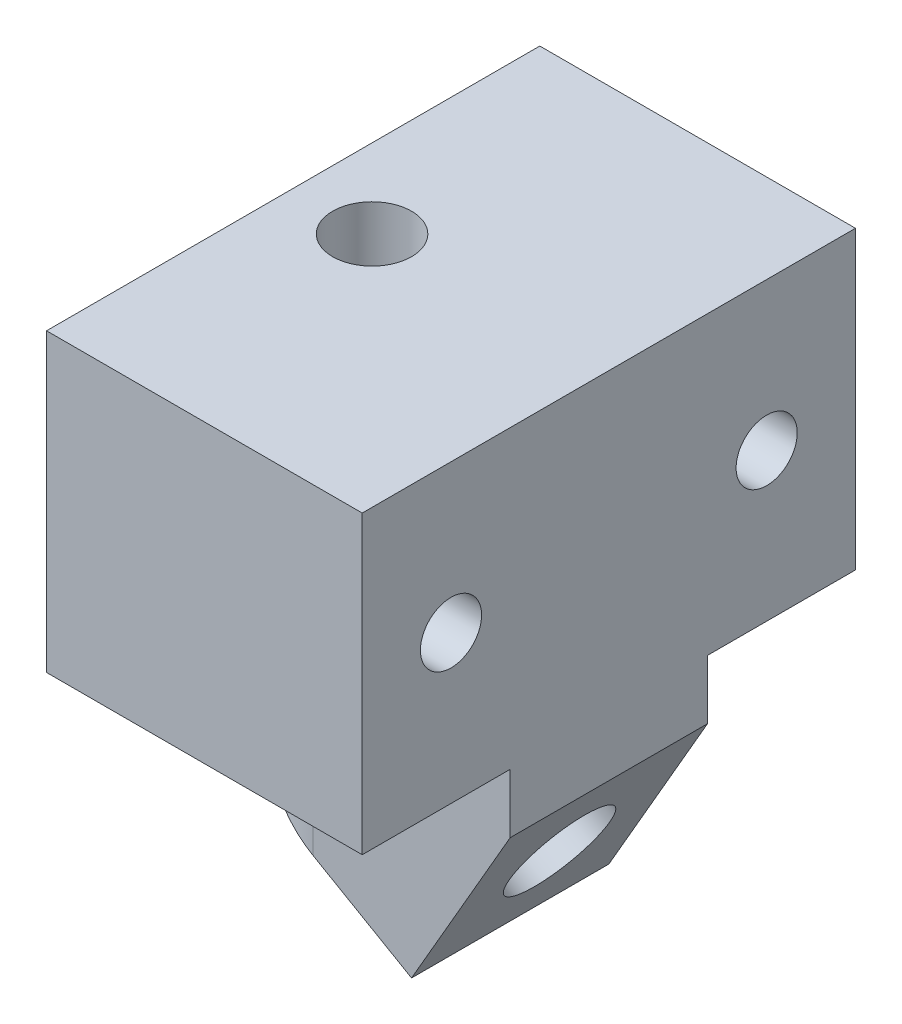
ISO-10303-21;
HEADER;
FILE_DESCRIPTION(('STEP AP214'),'2;1');
FILE_NAME('part.step','',(''),(''),'','','');
FILE_SCHEMA(('AUTOMOTIVE_DESIGN { 1 0 10303 214 1 1 1 1 }'));
ENDSEC;
DATA;
#1=APPLICATION_CONTEXT('core data for automotive mechanical design processes');
#2=APPLICATION_PROTOCOL_DEFINITION('international standard','automotive_design',2000,#1);
#3=PRODUCT_CONTEXT('',#1,'mechanical');
#4=PRODUCT('Part','Part','',(#3));
#5=PRODUCT_RELATED_PRODUCT_CATEGORY('part','',(#4));
#6=PRODUCT_DEFINITION_FORMATION('','',#4);
#7=PRODUCT_DEFINITION_CONTEXT('part definition',#1,'design');
#8=PRODUCT_DEFINITION('design','',#6,#7);
#9=PRODUCT_DEFINITION_SHAPE('','',#8);
#10=(LENGTH_UNIT() NAMED_UNIT(*) SI_UNIT(.MILLI.,.METRE.));
#11=(NAMED_UNIT(*) PLANE_ANGLE_UNIT() SI_UNIT($,.RADIAN.));
#12=(NAMED_UNIT(*) SI_UNIT($,.STERADIAN.) SOLID_ANGLE_UNIT());
#13=UNCERTAINTY_MEASURE_WITH_UNIT(LENGTH_MEASURE(1.E-05),#10,'distance_accuracy_value','');
#14=(GEOMETRIC_REPRESENTATION_CONTEXT(3) GLOBAL_UNCERTAINTY_ASSIGNED_CONTEXT((#13)) GLOBAL_UNIT_ASSIGNED_CONTEXT((#10,
#11,#12)) REPRESENTATION_CONTEXT('',''));
#15=CARTESIAN_POINT('',(0.,0.,0.));
#16=DIRECTION('',(0.,0.,1.));
#17=DIRECTION('',(1.,0.,0.));
#18=AXIS2_PLACEMENT_3D('',#15,#16,#17);
#19=CARTESIAN_POINT('',(16.,0.,0.));
#20=DIRECTION('',(0.,1.,0.));
#21=DIRECTION('',(0.,0.,1.));
#22=AXIS2_PLACEMENT_3D('',#19,#20,#21);
#23=PLANE('',#22);
#24=DIRECTION('',(0.,0.,-1.));
#25=VECTOR('',#24,1.);
#26=CARTESIAN_POINT('',(16.,0.,12.5));
#27=LINE('',#26,#25);
#28=CARTESIAN_POINT('',(16.,0.,-5.));
#29=VERTEX_POINT('',#28);
#30=CARTESIAN_POINT('',(16.,0.,-12.5));
#31=VERTEX_POINT('',#30);
#32=EDGE_CURVE('E260',#29,#31,#27,.T.);
#33=ORIENTED_EDGE('',*,*,#32,.F.);
#34=DIRECTION('',(-1.,0.,0.));
#35=VECTOR('',#34,1.);
#36=CARTESIAN_POINT('',(1.,0.,-5.));
#37=LINE('',#36,#35);
#38=CARTESIAN_POINT('',(6.,0.,-5.));
#39=VERTEX_POINT('',#38);
#40=EDGE_CURVE('E139',#29,#39,#37,.T.);
#41=ORIENTED_EDGE('',*,*,#40,.T.);
#42=CARTESIAN_POINT('',(6.,0.,0.));
#43=DIRECTION('',(0.,1.,0.));
#44=DIRECTION('',(0.,0.,1.));
#45=AXIS2_PLACEMENT_3D('',#42,#43,#44);
#46=CIRCLE('',#45,5.);
#47=CARTESIAN_POINT('',(1.,0.,0.));
#48=VERTEX_POINT('',#47);
#49=EDGE_CURVE('E63',#39,#48,#46,.T.);
#50=ORIENTED_EDGE('',*,*,#49,.T.);
#51=CARTESIAN_POINT('',(6.,0.,0.));
#52=DIRECTION('',(0.,1.,0.));
#53=DIRECTION('',(0.,0.,1.));
#54=AXIS2_PLACEMENT_3D('',#51,#52,#53);
#55=CIRCLE('',#54,5.);
#56=CARTESIAN_POINT('',(6.,0.,5.));
#57=VERTEX_POINT('',#56);
#58=EDGE_CURVE('E49',#48,#57,#55,.T.);
#59=ORIENTED_EDGE('',*,*,#58,.T.);
#60=DIRECTION('',(-1.,0.,0.));
#61=VECTOR('',#60,1.);
#62=CARTESIAN_POINT('',(1.,0.,5.));
#63=LINE('',#62,#61);
#64=CARTESIAN_POINT('',(16.,0.,5.));
#65=VERTEX_POINT('',#64);
#66=EDGE_CURVE('E147',#65,#57,#63,.T.);
#67=ORIENTED_EDGE('',*,*,#66,.F.);
#68=CARTESIAN_POINT('',(16.,0.,12.5));
#69=VERTEX_POINT('',#68);
#70=EDGE_CURVE('E265',#69,#65,#27,.T.);
#71=ORIENTED_EDGE('',*,*,#70,.F.);
#72=DIRECTION('',(-1.,0.,0.));
#73=VECTOR('',#72,1.);
#74=CARTESIAN_POINT('',(16.,0.,12.5));
#75=LINE('',#74,#73);
#76=CARTESIAN_POINT('',(0.,0.,12.5));
#77=VERTEX_POINT('',#76);
#78=EDGE_CURVE('E299',#69,#77,#75,.T.);
#79=ORIENTED_EDGE('',*,*,#78,.T.);
#80=DIRECTION('',(0.,0.,-1.));
#81=VECTOR('',#80,1.);
#82=CARTESIAN_POINT('',(0.,0.,0.));
#83=LINE('',#82,#81);
#84=CARTESIAN_POINT('',(0.,0.,-12.5));
#85=VERTEX_POINT('',#84);
#86=EDGE_CURVE('E300',#77,#85,#83,.T.);
#87=ORIENTED_EDGE('',*,*,#86,.T.);
#88=DIRECTION('',(-1.,0.,0.));
#89=VECTOR('',#88,1.);
#90=CARTESIAN_POINT('',(16.,0.,-12.5));
#91=LINE('',#90,#89);
#92=EDGE_CURVE('E162',#31,#85,#91,.T.);
#93=ORIENTED_EDGE('',*,*,#92,.F.);
#94=EDGE_LOOP('',(#33,#41,#50,#59,#67,#71,#79,#87,#93));
#95=FACE_BOUND('',#94,.T.);
#96=ADVANCED_FACE('F36',(#95),#23,.F.);
#97=CARTESIAN_POINT('',(16.,0.,-12.5));
#98=DIRECTION('',(0.,0.,1.));
#99=DIRECTION('',(1.,0.,0.));
#100=AXIS2_PLACEMENT_3D('',#97,#98,#99);
#101=PLANE('',#100);
#102=DIRECTION('',(0.,1.,0.));
#103=VECTOR('',#102,1.);
#104=CARTESIAN_POINT('',(0.,0.,-12.5));
#105=LINE('',#104,#103);
#106=CARTESIAN_POINT('',(0.,15.,-12.5));
#107=VERTEX_POINT('',#106);
#108=EDGE_CURVE('E302',#85,#107,#105,.T.);
#109=ORIENTED_EDGE('',*,*,#108,.T.);
#110=DIRECTION('',(-1.,0.,0.));
#111=VECTOR('',#110,1.);
#112=CARTESIAN_POINT('',(16.,15.,-12.5));
#113=LINE('',#112,#111);
#114=CARTESIAN_POINT('',(16.,15.,-12.5));
#115=VERTEX_POINT('',#114);
#116=EDGE_CURVE('E313',#115,#107,#113,.T.);
#117=ORIENTED_EDGE('',*,*,#116,.F.);
#118=DIRECTION('',(0.,1.,0.));
#119=VECTOR('',#118,1.);
#120=CARTESIAN_POINT('',(16.,0.,-12.5));
#121=LINE('',#120,#119);
#122=EDGE_CURVE('E292',#31,#115,#121,.T.);
#123=ORIENTED_EDGE('',*,*,#122,.F.);
#124=ORIENTED_EDGE('',*,*,#92,.T.);
#125=EDGE_LOOP('',(#109,#117,#123,#124));
#126=FACE_BOUND('',#125,.T.);
#127=ADVANCED_FACE('F232',(#126),#101,.F.);
#128=CARTESIAN_POINT('',(16.,15.,-12.5));
#129=DIRECTION('',(0.,-1.,0.));
#130=DIRECTION('',(0.,0.,-1.));
#131=AXIS2_PLACEMENT_3D('',#128,#129,#130);
#132=PLANE('',#131);
#133=CARTESIAN_POINT('',(4.,15.,0.));
#134=DIRECTION('',(0.,1.,0.));
#135=DIRECTION('',(0.,0.,1.));
#136=AXIS2_PLACEMENT_3D('',#133,#134,#135);
#137=CIRCLE('',#136,2.);
#138=CARTESIAN_POINT('',(4.,15.,2.));
#139=VERTEX_POINT('',#138);
#140=EDGE_CURVE('E133',#139,#139,#137,.T.);
#141=ORIENTED_EDGE('',*,*,#140,.F.);
#142=EDGE_LOOP('',(#141));
#143=FACE_BOUND('',#142,.T.);
#144=DIRECTION('',(0.,0.,1.));
#145=VECTOR('',#144,1.);
#146=CARTESIAN_POINT('',(0.,15.,-12.5));
#147=LINE('',#146,#145);
#148=CARTESIAN_POINT('',(0.,15.,12.5));
#149=VERTEX_POINT('',#148);
#150=EDGE_CURVE('E304',#107,#149,#147,.T.);
#151=ORIENTED_EDGE('',*,*,#150,.T.);
#152=DIRECTION('',(-1.,0.,0.));
#153=VECTOR('',#152,1.);
#154=CARTESIAN_POINT('',(16.,15.,12.5));
#155=LINE('',#154,#153);
#156=CARTESIAN_POINT('',(16.,15.,12.5));
#157=VERTEX_POINT('',#156);
#158=EDGE_CURVE('E310',#157,#149,#155,.T.);
#159=ORIENTED_EDGE('',*,*,#158,.F.);
#160=DIRECTION('',(0.,0.,1.));
#161=VECTOR('',#160,1.);
#162=CARTESIAN_POINT('',(16.,15.,-12.5));
#163=LINE('',#162,#161);
#164=EDGE_CURVE('E295',#115,#157,#163,.T.);
#165=ORIENTED_EDGE('',*,*,#164,.F.);
#166=ORIENTED_EDGE('',*,*,#116,.T.);
#167=EDGE_LOOP('',(#151,#159,#165,#166));
#168=FACE_BOUND('',#167,.T.);
#169=ADVANCED_FACE('F237',(#143,#168),#132,.F.);
#170=CARTESIAN_POINT('',(16.,15.,12.5));
#171=DIRECTION('',(0.,0.,-1.));
#172=DIRECTION('',(0.,1.,0.));
#173=AXIS2_PLACEMENT_3D('',#170,#171,#172);
#174=PLANE('',#173);
#175=DIRECTION('',(0.,-1.,0.));
#176=VECTOR('',#175,1.);
#177=CARTESIAN_POINT('',(0.,15.,12.5));
#178=LINE('',#177,#176);
#179=EDGE_CURVE('E266',#149,#77,#178,.T.);
#180=ORIENTED_EDGE('',*,*,#179,.T.);
#181=ORIENTED_EDGE('',*,*,#78,.F.);
#182=DIRECTION('',(0.,-1.,0.));
#183=VECTOR('',#182,1.);
#184=CARTESIAN_POINT('',(16.,15.,12.5));
#185=LINE('',#184,#183);
#186=EDGE_CURVE('E297',#157,#69,#185,.T.);
#187=ORIENTED_EDGE('',*,*,#186,.F.);
#188=ORIENTED_EDGE('',*,*,#158,.T.);
#189=EDGE_LOOP('',(#180,#181,#187,#188));
#190=FACE_BOUND('',#189,.T.);
#191=ADVANCED_FACE('F326',(#190),#174,.F.);
#192=CARTESIAN_POINT('',(16.,0.,0.));
#193=DIRECTION('',(1.,0.,0.));
#194=DIRECTION('',(0.,0.,-1.));
#195=AXIS2_PLACEMENT_3D('',#192,#193,#194);
#196=PLANE('',#195);
#197=CARTESIAN_POINT('',(16.,7.5,-8.));
#198=DIRECTION('',(1.,0.,0.));
#199=DIRECTION('',(0.,0.,-1.));
#200=AXIS2_PLACEMENT_3D('',#197,#198,#199);
#201=CIRCLE('',#200,1.54999999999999);
#202=CARTESIAN_POINT('',(16.,7.5,-9.54999999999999));
#203=VERTEX_POINT('',#202);
#204=EDGE_CURVE('E196',#203,#203,#201,.T.);
#205=ORIENTED_EDGE('',*,*,#204,.F.);
#206=EDGE_LOOP('',(#205));
#207=FACE_BOUND('',#206,.T.);
#208=CARTESIAN_POINT('',(16.,7.5,8.));
#209=DIRECTION('',(1.,0.,0.));
#210=DIRECTION('',(0.,0.,-1.));
#211=AXIS2_PLACEMENT_3D('',#208,#209,#210);
#212=CIRCLE('',#211,1.54999999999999);
#213=CARTESIAN_POINT('',(16.,7.5,6.45000000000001));
#214=VERTEX_POINT('',#213);
#215=EDGE_CURVE('E176',#214,#214,#212,.T.);
#216=ORIENTED_EDGE('',*,*,#215,.F.);
#217=EDGE_LOOP('',(#216));
#218=FACE_BOUND('',#217,.T.);
#219=ORIENTED_EDGE('',*,*,#70,.T.);
#220=DIRECTION('',(0.,1.,0.));
#221=VECTOR('',#220,1.);
#222=CARTESIAN_POINT('',(16.,0.,5.));
#223=LINE('',#222,#221);
#224=CARTESIAN_POINT('',(16.,-3.,5.));
#225=VERTEX_POINT('',#224);
#226=EDGE_CURVE('E149',#225,#65,#223,.T.);
#227=ORIENTED_EDGE('',*,*,#226,.F.);
#228=DIRECTION('',(0.,0.,-1.));
#229=VECTOR('',#228,1.);
#230=CARTESIAN_POINT('',(16.,-3.,5.));
#231=LINE('',#230,#229);
#232=CARTESIAN_POINT('',(16.,-3.,-5.));
#233=VERTEX_POINT('',#232);
#234=EDGE_CURVE('E274',#225,#233,#231,.T.);
#235=ORIENTED_EDGE('',*,*,#234,.T.);
#236=DIRECTION('',(0.,1.,0.));
#237=VECTOR('',#236,1.);
#238=CARTESIAN_POINT('',(16.,0.,-5.));
#239=LINE('',#238,#237);
#240=EDGE_CURVE('E269',#233,#29,#239,.T.);
#241=ORIENTED_EDGE('',*,*,#240,.T.);
#242=ORIENTED_EDGE('',*,*,#32,.T.);
#243=ORIENTED_EDGE('',*,*,#122,.T.);
#244=ORIENTED_EDGE('',*,*,#164,.T.);
#245=ORIENTED_EDGE('',*,*,#186,.T.);
#246=EDGE_LOOP('',(#219,#227,#235,#241,#242,#243,#244,#245));
#247=FACE_BOUND('',#246,.T.);
#248=ADVANCED_FACE('F271',(#207,#218,#247),#196,.T.);
#249=CARTESIAN_POINT('',(0.,0.,0.));
#250=DIRECTION('',(1.,0.,0.));
#251=DIRECTION('',(0.,0.,-1.));
#252=AXIS2_PLACEMENT_3D('',#249,#250,#251);
#253=PLANE('',#252);
#254=CARTESIAN_POINT('',(0.,7.5,-8.));
#255=DIRECTION('',(-1.,0.,0.));
#256=DIRECTION('',(0.,0.,1.));
#257=AXIS2_PLACEMENT_3D('',#254,#255,#256);
#258=CIRCLE('',#257,1.54999999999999);
#259=CARTESIAN_POINT('',(0.,7.5,-6.45000000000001));
#260=VERTEX_POINT('',#259);
#261=EDGE_CURVE('E199',#260,#260,#258,.T.);
#262=ORIENTED_EDGE('',*,*,#261,.F.);
#263=EDGE_LOOP('',(#262));
#264=FACE_BOUND('',#263,.T.);
#265=CARTESIAN_POINT('',(0.,7.5,8.));
#266=DIRECTION('',(-1.,0.,0.));
#267=DIRECTION('',(0.,0.,1.));
#268=AXIS2_PLACEMENT_3D('',#265,#266,#267);
#269=CIRCLE('',#268,1.54999999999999);
#270=CARTESIAN_POINT('',(0.,7.5,9.54999999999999));
#271=VERTEX_POINT('',#270);
#272=EDGE_CURVE('E193',#271,#271,#269,.T.);
#273=ORIENTED_EDGE('',*,*,#272,.F.);
#274=EDGE_LOOP('',(#273));
#275=FACE_BOUND('',#274,.T.);
#276=ORIENTED_EDGE('',*,*,#86,.F.);
#277=ORIENTED_EDGE('',*,*,#179,.F.);
#278=ORIENTED_EDGE('',*,*,#150,.F.);
#279=ORIENTED_EDGE('',*,*,#108,.F.);
#280=EDGE_LOOP('',(#276,#277,#278,#279));
#281=FACE_BOUND('',#280,.T.);
#282=ADVANCED_FACE('F319',(#264,#275,#281),#253,.F.);
#283=CARTESIAN_POINT('',(11.,-11.6602540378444,5.));
#284=DIRECTION('',(0.500000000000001,0.866025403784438,0.));
#285=DIRECTION('',(-0.866025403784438,0.500000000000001,0.));
#286=AXIS2_PLACEMENT_3D('',#283,#284,#285);
#287=PLANE('',#286);
#288=CARTESIAN_POINT('',(6.,-8.77350269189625,0.));
#289=DIRECTION('',(0.500000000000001,0.866025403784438,0.));
#290=DIRECTION('',(0.866025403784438,-0.500000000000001,0.));
#291=AXIS2_PLACEMENT_3D('',#288,#289,#290);
#292=ELLIPSE('',#291,5.77350269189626,5.);
#293=CARTESIAN_POINT('',(6.,-8.77350269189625,5.));
#294=VERTEX_POINT('',#293);
#295=CARTESIAN_POINT('',(1.,-5.88675134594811,0.));
#296=VERTEX_POINT('',#295);
#297=EDGE_CURVE('E159',#294,#296,#292,.F.);
#298=ORIENTED_EDGE('',*,*,#297,.T.);
#299=CARTESIAN_POINT('',(6.,-8.77350269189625,0.));
#300=DIRECTION('',(0.500000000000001,0.866025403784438,0.));
#301=DIRECTION('',(-0.866025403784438,0.500000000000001,0.));
#302=AXIS2_PLACEMENT_3D('',#299,#300,#301);
#303=ELLIPSE('',#302,5.77350269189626,5.);
#304=CARTESIAN_POINT('',(6.,-8.77350269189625,-5.));
#305=VERTEX_POINT('',#304);
#306=EDGE_CURVE('E161',#296,#305,#303,.F.);
#307=ORIENTED_EDGE('',*,*,#306,.T.);
#308=DIRECTION('',(0.866025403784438,-0.500000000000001,0.));
#309=VECTOR('',#308,1.);
#310=CARTESIAN_POINT('',(11.,-11.6602540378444,-5.));
#311=LINE('',#310,#309);
#312=CARTESIAN_POINT('',(11.,-11.6602540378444,-5.));
#313=VERTEX_POINT('',#312);
#314=EDGE_CURVE('E152',#305,#313,#311,.T.);
#315=ORIENTED_EDGE('',*,*,#314,.T.);
#316=DIRECTION('',(0.,0.,-1.));
#317=VECTOR('',#316,1.);
#318=CARTESIAN_POINT('',(11.,-11.6602540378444,5.));
#319=LINE('',#318,#317);
#320=CARTESIAN_POINT('',(11.,-11.6602540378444,5.));
#321=VERTEX_POINT('',#320);
#322=EDGE_CURVE('E290',#321,#313,#319,.T.);
#323=ORIENTED_EDGE('',*,*,#322,.F.);
#324=DIRECTION('',(0.866025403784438,-0.500000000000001,0.));
#325=VECTOR('',#324,1.);
#326=CARTESIAN_POINT('',(11.,-11.6602540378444,5.));
#327=LINE('',#326,#325);
#328=EDGE_CURVE('E144',#294,#321,#327,.T.);
#329=ORIENTED_EDGE('',*,*,#328,.F.);
#330=EDGE_LOOP('',(#298,#307,#315,#323,#329));
#331=FACE_BOUND('',#330,.T.);
#332=ADVANCED_FACE('F339',(#331),#287,.F.);
#333=CARTESIAN_POINT('',(16.,-3.,5.));
#334=DIRECTION('',(-0.866025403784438,0.500000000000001,0.));
#335=DIRECTION('',(-0.500000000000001,-0.866025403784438,0.));
#336=AXIS2_PLACEMENT_3D('',#333,#334,#335);
#337=PLANE('',#336);
#338=CARTESIAN_POINT('',(13.5,-7.33012701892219,0.));
#339=DIRECTION('',(0.866025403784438,-0.500000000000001,0.));
#340=DIRECTION('',(0.500000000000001,0.866025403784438,0.));
#341=AXIS2_PLACEMENT_3D('',#338,#339,#340);
#342=CIRCLE('',#341,2.5527);
#343=CARTESIAN_POINT('',(14.77635,-5.11942397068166,0.));
#344=VERTEX_POINT('',#343);
#345=EDGE_CURVE('E132',#344,#344,#342,.T.);
#346=ORIENTED_EDGE('',*,*,#345,.F.);
#347=EDGE_LOOP('',(#346));
#348=FACE_BOUND('',#347,.T.);
#349=DIRECTION('',(0.500000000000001,0.866025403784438,0.));
#350=VECTOR('',#349,1.);
#351=CARTESIAN_POINT('',(16.,-3.,-5.));
#352=LINE('',#351,#350);
#353=EDGE_CURVE('E275',#313,#233,#352,.T.);
#354=ORIENTED_EDGE('',*,*,#353,.T.);
#355=ORIENTED_EDGE('',*,*,#234,.F.);
#356=DIRECTION('',(0.500000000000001,0.866025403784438,0.));
#357=VECTOR('',#356,1.);
#358=CARTESIAN_POINT('',(16.,-3.,5.));
#359=LINE('',#358,#357);
#360=EDGE_CURVE('E146',#321,#225,#359,.T.);
#361=ORIENTED_EDGE('',*,*,#360,.F.);
#362=ORIENTED_EDGE('',*,*,#322,.T.);
#363=EDGE_LOOP('',(#354,#355,#361,#362));
#364=FACE_BOUND('',#363,.T.);
#365=ADVANCED_FACE('F337',(#348,#364),#337,.F.);
#366=CARTESIAN_POINT('',(0.,0.,5.));
#367=DIRECTION('',(0.,0.,-1.));
#368=DIRECTION('',(-1.,0.,0.));
#369=AXIS2_PLACEMENT_3D('',#366,#367,#368);
#370=PLANE('',#369);
#371=CARTESIAN_POINT('',(9.16987298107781,-4.83012701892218,5.));
#372=DIRECTION('',(0.,0.,1.));
#373=DIRECTION('',(1.,0.,0.));
#374=AXIS2_PLACEMENT_3D('',#371,#372,#373);
#375=CIRCLE('',#374,1.25);
#376=CARTESIAN_POINT('',(10.4198729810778,-4.83012701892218,5.));
#377=VERTEX_POINT('',#376);
#378=EDGE_CURVE('E205',#377,#377,#375,.T.);
#379=ORIENTED_EDGE('',*,*,#378,.F.);
#380=EDGE_LOOP('',(#379));
#381=FACE_BOUND('',#380,.T.);
#382=ORIENTED_EDGE('',*,*,#66,.T.);
#383=DIRECTION('',(0.,-1.,0.));
#384=VECTOR('',#383,1.);
#385=CARTESIAN_POINT('',(6.,0.,5.));
#386=LINE('',#385,#384);
#387=EDGE_CURVE('E167',#57,#294,#386,.T.);
#388=ORIENTED_EDGE('',*,*,#387,.T.);
#389=ORIENTED_EDGE('',*,*,#328,.T.);
#390=ORIENTED_EDGE('',*,*,#360,.T.);
#391=ORIENTED_EDGE('',*,*,#226,.T.);
#392=EDGE_LOOP('',(#382,#388,#389,#390,#391));
#393=FACE_BOUND('',#392,.T.);
#394=ADVANCED_FACE('F330',(#381,#393),#370,.F.);
#395=CARTESIAN_POINT('',(0.,0.,-5.));
#396=DIRECTION('',(0.,0.,-1.));
#397=DIRECTION('',(-1.,0.,0.));
#398=AXIS2_PLACEMENT_3D('',#395,#396,#397);
#399=PLANE('',#398);
#400=CARTESIAN_POINT('',(9.16987298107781,-4.83012701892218,-5.));
#401=DIRECTION('',(0.,0.,-1.));
#402=DIRECTION('',(-1.,0.,0.));
#403=AXIS2_PLACEMENT_3D('',#400,#401,#402);
#404=CIRCLE('',#403,1.25);
#405=CARTESIAN_POINT('',(7.91987298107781,-4.83012701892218,-5.));
#406=VERTEX_POINT('',#405);
#407=EDGE_CURVE('E202',#406,#406,#404,.T.);
#408=ORIENTED_EDGE('',*,*,#407,.F.);
#409=EDGE_LOOP('',(#408));
#410=FACE_BOUND('',#409,.T.);
#411=ORIENTED_EDGE('',*,*,#314,.F.);
#412=DIRECTION('',(0.,-1.,0.));
#413=VECTOR('',#412,1.);
#414=CARTESIAN_POINT('',(6.,0.,-5.));
#415=LINE('',#414,#413);
#416=EDGE_CURVE('E164',#305,#39,#415,.F.);
#417=ORIENTED_EDGE('',*,*,#416,.T.);
#418=ORIENTED_EDGE('',*,*,#40,.F.);
#419=ORIENTED_EDGE('',*,*,#240,.F.);
#420=ORIENTED_EDGE('',*,*,#353,.F.);
#421=EDGE_LOOP('',(#411,#417,#418,#419,#420));
#422=FACE_BOUND('',#421,.T.);
#423=ADVANCED_FACE('F249',(#410,#422),#399,.T.);
#424=CARTESIAN_POINT('',(6.,0.,0.));
#425=DIRECTION('',(0.,-1.,0.));
#426=DIRECTION('',(0.,0.,-1.));
#427=AXIS2_PLACEMENT_3D('',#424,#425,#426);
#428=CYLINDRICAL_SURFACE('',#427,5.);
#429=ORIENTED_EDGE('',*,*,#387,.F.);
#430=ORIENTED_EDGE('',*,*,#58,.F.);
#431=DIRECTION('',(0.,-1.,0.));
#432=VECTOR('',#431,1.);
#433=CARTESIAN_POINT('',(1.,-5.88675134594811,0.));
#434=LINE('',#433,#432);
#435=EDGE_CURVE('E136',#296,#48,#434,.F.);
#436=ORIENTED_EDGE('',*,*,#435,.F.);
#437=ORIENTED_EDGE('',*,*,#297,.F.);
#438=EDGE_LOOP('',(#429,#430,#436,#437));
#439=FACE_BOUND('',#438,.T.);
#440=ADVANCED_FACE('F38',(#439),#428,.T.);
#441=CARTESIAN_POINT('',(6.,-5.88675134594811,0.));
#442=DIRECTION('',(0.,1.,0.));
#443=DIRECTION('',(0.,0.,1.));
#444=AXIS2_PLACEMENT_3D('',#441,#442,#443);
#445=CYLINDRICAL_SURFACE('',#444,5.);
#446=ORIENTED_EDGE('',*,*,#49,.F.);
#447=ORIENTED_EDGE('',*,*,#416,.F.);
#448=ORIENTED_EDGE('',*,*,#306,.F.);
#449=ORIENTED_EDGE('',*,*,#435,.T.);
#450=EDGE_LOOP('',(#446,#447,#448,#449));
#451=FACE_BOUND('',#450,.T.);
#452=ADVANCED_FACE('F241',(#451),#445,.T.);
#453=CARTESIAN_POINT('',(3.10769515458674,-1.33012701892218,0.));
#454=DIRECTION('',(0.866025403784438,-0.500000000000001,0.));
#455=DIRECTION('',(0.500000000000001,0.866025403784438,0.));
#456=AXIS2_PLACEMENT_3D('',#453,#454,#455);
#457=CONICAL_SURFACE('',#456,2.5527,1.02974425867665);
#458=CARTESIAN_POINT('',(1.77937075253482,-0.563218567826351,0.));
#459=VERTEX_POINT('',#458);
#460=VERTEX_LOOP('',#459);
#461=FACE_BOUND('',#460,.T.);
#462=CARTESIAN_POINT('',(3.10769515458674,-1.33012701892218,0.));
#463=DIRECTION('',(0.866025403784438,-0.500000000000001,0.));
#464=DIRECTION('',(0.500000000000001,0.866025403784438,0.));
#465=AXIS2_PLACEMENT_3D('',#462,#463,#464);
#466=CIRCLE('',#465,2.5527);
#467=CARTESIAN_POINT('',(3.90233588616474,0.0462311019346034,1.99761400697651));
#468=VERTEX_POINT('',#467);
#469=CARTESIAN_POINT('',(3.90233588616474,0.0462311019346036,-1.99761400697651));
#470=VERTEX_POINT('',#469);
#471=EDGE_CURVE('E131',#468,#470,#466,.T.);
#472=ORIENTED_EDGE('',*,*,#471,.T.);
#473=CARTESIAN_POINT('',(4.38424515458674,0.435061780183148,-1.96274187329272));
#474=CARTESIAN_POINT('',(4.3142192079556,0.377960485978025,-1.97643471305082));
#475=CARTESIAN_POINT('',(4.24365538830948,0.320618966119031,-1.98637366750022));
#476=CARTESIAN_POINT('',(4.10177834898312,0.205907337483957,-1.99868286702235));
#477=CARTESIAN_POINT('',(4.03046445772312,0.148537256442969,-2.00104562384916));
#478=CARTESIAN_POINT('',(3.8868610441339,0.0337818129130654,-1.99809995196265));
#479=CARTESIAN_POINT('',(3.81456876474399,-0.0235983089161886,-1.99271695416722));
#480=CARTESIAN_POINT('',(3.67014205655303,-0.137153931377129,-1.97395382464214));
#481=CARTESIAN_POINT('',(3.59800756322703,-0.193330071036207,-1.96057804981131));
#482=CARTESIAN_POINT('',(3.42541840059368,-0.325926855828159,-1.91849290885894));
#483=CARTESIAN_POINT('',(3.32520151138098,-0.401436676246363,-1.8857864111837));
#484=CARTESIAN_POINT('',(3.12739603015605,-0.545515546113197,-1.80278319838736));
#485=CARTESIAN_POINT('',(3.02979921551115,-0.614108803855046,-1.75255078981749));
#486=CARTESIAN_POINT('',(2.87576054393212,-0.714928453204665,-1.65555988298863));
#487=CARTESIAN_POINT('',(2.81796236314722,-0.750978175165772,-1.61493243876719));
#488=CARTESIAN_POINT('',(2.70468584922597,-0.816195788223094,-1.5255656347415));
#489=CARTESIAN_POINT('',(2.64920527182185,-0.845370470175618,-1.47683436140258));
#490=CARTESIAN_POINT('',(2.55612134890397,-0.886895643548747,-1.38501877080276));
#491=CARTESIAN_POINT('',(2.51769067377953,-0.901657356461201,-1.34388462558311));
#492=CARTESIAN_POINT('',(2.44359778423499,-0.92354597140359,-1.25731360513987));
#493=CARTESIAN_POINT('',(2.40793018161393,-0.930688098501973,-1.21188550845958));
#494=CARTESIAN_POINT('',(2.34550704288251,-0.934939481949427,-1.12475835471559));
#495=CARTESIAN_POINT('',(2.31821610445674,-0.93338799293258,-1.08351584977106));
#496=CARTESIAN_POINT('',(2.26719400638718,-0.922518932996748,-0.999889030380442));
#497=CARTESIAN_POINT('',(2.2434599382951,-0.913207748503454,-0.957505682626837));
#498=CARTESIAN_POINT('',(2.20006118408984,-0.887284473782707,-0.87319308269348));
#499=CARTESIAN_POINT('',(2.18037939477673,-0.870704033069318,-0.831262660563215));
#500=CARTESIAN_POINT('',(2.14479870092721,-0.831751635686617,-0.748510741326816));
#501=CARTESIAN_POINT('',(2.12890516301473,-0.809371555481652,-0.707690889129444));
#502=CARTESIAN_POINT('',(2.1048287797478,-0.76837241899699,-0.639682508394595));
#503=CARTESIAN_POINT('',(2.09578170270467,-0.750732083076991,-0.612184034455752));
#504=CARTESIAN_POINT('',(2.07906077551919,-0.714338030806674,-0.557503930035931));
#505=CARTESIAN_POINT('',(2.07138726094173,-0.695584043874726,-0.530322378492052));
#506=CARTESIAN_POINT('',(2.0572431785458,-0.657654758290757,-0.475907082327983));
#507=CARTESIAN_POINT('',(2.05077379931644,-0.638479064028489,-0.448673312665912));
#508=CARTESIAN_POINT('',(2.03893159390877,-0.600534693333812,-0.393701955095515));
#509=CARTESIAN_POINT('',(2.03355819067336,-0.581765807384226,-0.365964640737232));
#510=CARTESIAN_POINT('',(2.0239961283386,-0.546173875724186,-0.310143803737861));
#511=CARTESIAN_POINT('',(2.0197788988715,-0.529311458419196,-0.282090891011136));
#512=CARTESIAN_POINT('',(2.01240686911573,-0.498403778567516,-0.224318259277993));
#513=CARTESIAN_POINT('',(2.00925029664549,-0.484353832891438,-0.194601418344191));
#514=CARTESIAN_POINT('',(2.00479870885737,-0.463945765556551,-0.140435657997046));
#515=CARTESIAN_POINT('',(2.00323955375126,-0.456553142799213,-0.116413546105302));
#516=CARTESIAN_POINT('',(2.00098909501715,-0.445768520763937,-0.0674650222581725));
#517=CARTESIAN_POINT('',(2.00029549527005,-0.442365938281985,-0.0425411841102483));
#518=CARTESIAN_POINT('',(1.99985637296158,-0.440220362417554,0.00768528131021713));
#519=CARTESIAN_POINT('',(2.0001168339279,-0.44150677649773,0.0329893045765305));
#520=CARTESIAN_POINT('',(2.00156368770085,-0.448525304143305,0.0829475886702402));
#521=CARTESIAN_POINT('',(2.0027516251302,-0.454264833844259,0.107600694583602));
#522=CARTESIAN_POINT('',(2.00677083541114,-0.473117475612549,0.168545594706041));
#523=CARTESIAN_POINT('',(2.01013997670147,-0.488528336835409,0.204058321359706));
#524=CARTESIAN_POINT('',(2.0183834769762,-0.52369893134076,0.272779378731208));
#525=CARTESIAN_POINT('',(2.02326818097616,-0.543488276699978,0.305969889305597));
#526=CARTESIAN_POINT('',(2.03516522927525,-0.587719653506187,0.375258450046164));
#527=CARTESIAN_POINT('',(2.04237546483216,-0.612429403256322,0.411146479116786));
#528=CARTESIAN_POINT('',(2.0586991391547,-0.662075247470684,0.482375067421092));
#529=CARTESIAN_POINT('',(2.06781467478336,-0.687011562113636,0.517714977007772));
#530=CARTESIAN_POINT('',(2.08819777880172,-0.735286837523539,0.588521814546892));
#531=CARTESIAN_POINT('',(2.09945009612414,-0.758635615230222,0.623986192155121));
#532=CARTESIAN_POINT('',(2.12454367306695,-0.802410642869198,0.695777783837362));
#533=CARTESIAN_POINT('',(2.13838209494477,-0.822840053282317,0.732104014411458));
#534=CARTESIAN_POINT('',(2.17162684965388,-0.862408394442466,0.811919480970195));
#535=CARTESIAN_POINT('',(2.19157746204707,-0.880758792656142,0.855589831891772));
#536=CARTESIAN_POINT('',(2.23580269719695,-0.909645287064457,0.943406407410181));
#537=CARTESIAN_POINT('',(2.26007833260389,-0.920179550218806,0.987552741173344));
#538=CARTESIAN_POINT('',(2.31253746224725,-0.93282609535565,1.07473664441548));
#539=CARTESIAN_POINT('',(2.34072322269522,-0.934933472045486,1.11777355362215));
#540=CARTESIAN_POINT('',(2.40018411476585,-0.931509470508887,1.20134590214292));
#541=CARTESIAN_POINT('',(2.43146390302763,-0.925966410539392,1.2418774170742));
#542=CARTESIAN_POINT('',(2.50888161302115,-0.905315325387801,1.33472860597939));
#543=CARTESIAN_POINT('',(2.55607175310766,-0.887328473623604,1.38551247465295));
#544=CARTESIAN_POINT('',(2.65330764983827,-0.843041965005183,1.48022247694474));
#545=CARTESIAN_POINT('',(2.70335995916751,-0.816722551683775,1.52413193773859));
#546=CARTESIAN_POINT('',(2.83589932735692,-0.74099098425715,1.62963939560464));
#547=CARTESIAN_POINT('',(2.91990581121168,-0.687174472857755,1.68614133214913));
#548=CARTESIAN_POINT('',(3.09085536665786,-0.571307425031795,1.78415101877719));
#549=CARTESIAN_POINT('',(3.17780466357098,-0.50923849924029,1.82562448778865));
#550=CARTESIAN_POINT('',(3.39409813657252,-0.350293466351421,1.91101206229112));
#551=CARTESIAN_POINT('',(3.52444167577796,-0.250601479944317,1.94717477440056));
#552=CARTESIAN_POINT('',(3.78595491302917,-0.0466523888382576,1.99293272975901));
#553=CARTESIAN_POINT('',(3.91712444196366,0.0576038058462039,2.00253324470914));
#554=CARTESIAN_POINT('',(4.10409761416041,0.207808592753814,1.99809124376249));
#555=CARTESIAN_POINT('',(4.16058543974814,0.253399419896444,1.99434669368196));
#556=CARTESIAN_POINT('',(4.27290321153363,0.344390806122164,1.98209488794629));
#557=CARTESIAN_POINT('',(4.32873465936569,0.389791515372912,1.97360251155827));
#558=CARTESIAN_POINT('',(4.38424515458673,0.435061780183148,1.96274187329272));
#559=B_SPLINE_CURVE_WITH_KNOTS('',3,(#473,#474,#475,#476,#477,#478,#479,#480,#481,#482,#483,
#484,#485,#486,#487,#488,#489,#490,#491,#492,#493,#494,#495,#496,#497,#498,#499,#500,#501,#502,
#503,#504,#505,#506,#507,#508,#509,#510,#511,#512,#513,#514,#515,#516,#517,#518,#519,#520,#521,
#522,#523,#524,#525,#526,#527,#528,#529,#530,#531,#532,#533,#534,#535,#536,#537,#538,#539,#540,
#541,#542,#543,#544,#545,#546,#547,#548,#549,#550,#551,#552,#553,#554,#555,#556,#557,#558),
.UNSPECIFIED.,.F.,.F.,(4,2,2,2,2,2,2,2,2,2,2,2,2,2,2,2,2,2,2,2,2,2,2,2,2,2,2,2,2,2,2,2,2,2,2,2,
2,2,2,2,2,2,4),(0.,0.27408298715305,0.548436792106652,0.825449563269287,1.10231147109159,
1.49014690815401,1.87657400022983,2.11397651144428,2.35114353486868,2.52517465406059,
2.69885737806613,2.84659721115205,2.99421557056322,3.14119750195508,3.28838643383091,
3.39003550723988,3.49170937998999,3.59348308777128,3.6952030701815,3.79411962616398,
3.89287007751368,3.96814807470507,4.04322594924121,4.1187754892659,4.19445111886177,
4.31035208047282,4.42706224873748,4.55948273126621,4.69204972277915,4.82370386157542,
4.95521437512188,5.10874003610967,5.26230169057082,5.41595272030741,5.56983862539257,
5.78349352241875,5.99765883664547,6.33972022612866,6.68255704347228,7.1840394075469,
7.68542223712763,7.90335216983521,8.12060292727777),.UNSPECIFIED.);
#560=EDGE_CURVE('E11',#470,#468,#559,.T.);
#561=ORIENTED_EDGE('',*,*,#560,.T.);
#562=EDGE_LOOP('',(#472,#561));
#563=FACE_BOUND('',#562,.T.);
#564=ADVANCED_FACE('F135',(#461,#563),#457,.F.);
#565=CARTESIAN_POINT('',(13.5,-7.33012701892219,0.));
#566=DIRECTION('',(0.866025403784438,-0.500000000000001,0.));
#567=DIRECTION('',(0.500000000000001,0.866025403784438,0.));
#568=AXIS2_PLACEMENT_3D('',#565,#566,#567);
#569=CYLINDRICAL_SURFACE('',#568,2.5527);
#570=CARTESIAN_POINT('',(10.4198729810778,-4.83012701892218,-2.47500551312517));
#571=CARTESIAN_POINT('',(10.4198707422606,-4.89460718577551,-2.4891051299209));
#572=CARTESIAN_POINT('',(10.4148727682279,-4.95942609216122,-2.50189043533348));
#573=CARTESIAN_POINT('',(10.3946846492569,-5.08816678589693,-2.52365232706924));
#574=CARTESIAN_POINT('',(10.3794876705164,-5.15208794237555,-2.53262635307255));
#575=CARTESIAN_POINT('',(10.338981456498,-5.27737095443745,-2.54589309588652));
#576=CARTESIAN_POINT('',(10.3136457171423,-5.33872563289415,-2.55017343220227));
#577=CARTESIAN_POINT('',(10.2534991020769,-5.4567351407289,-2.55355634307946));
#578=CARTESIAN_POINT('',(10.2186918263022,-5.51339174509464,-2.55266088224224));
#579=CARTESIAN_POINT('',(10.1423551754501,-5.61803510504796,-2.5459393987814));
#580=CARTESIAN_POINT('',(10.1011661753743,-5.66628468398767,-2.54032029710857));
#581=CARTESIAN_POINT('',(10.0123724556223,-5.75568998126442,-2.5249581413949));
#582=CARTESIAN_POINT('',(9.96476645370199,-5.79684427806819,-2.51521426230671));
#583=CARTESIAN_POINT('',(9.8629421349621,-5.8723823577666,-2.49212187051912));
#584=CARTESIAN_POINT('',(9.80856726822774,-5.90652345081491,-2.47867316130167));
#585=CARTESIAN_POINT('',(9.69573697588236,-5.96592497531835,-2.44948949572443));
#586=CARTESIAN_POINT('',(9.63727983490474,-5.99118164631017,-2.43375357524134));
#587=CARTESIAN_POINT('',(9.51175400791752,-6.03446651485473,-2.39976456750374));
#588=CARTESIAN_POINT('',(9.44439495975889,-6.05157930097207,-2.38141439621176));
#589=CARTESIAN_POINT('',(9.30755238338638,-6.07445859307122,-2.34540186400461));
#590=CARTESIAN_POINT('',(9.2380675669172,-6.08021807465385,-2.32773993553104));
#591=CARTESIAN_POINT('',(9.09543276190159,-6.08002989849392,-2.2943919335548));
#592=CARTESIAN_POINT('',(9.02225359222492,-6.07356848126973,-2.27882339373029));
#593=CARTESIAN_POINT('',(8.87731050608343,-6.04762845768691,-2.25288228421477));
#594=CARTESIAN_POINT('',(8.80554494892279,-6.02816598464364,-2.24250330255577));
#595=CARTESIAN_POINT('',(8.67263557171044,-5.97894859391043,-2.22936883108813));
#596=CARTESIAN_POINT('',(8.61112941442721,-5.9503426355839,-2.22598458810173));
#597=CARTESIAN_POINT('',(8.49355670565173,-5.88353215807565,-2.22546524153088));
#598=CARTESIAN_POINT('',(8.43748810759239,-5.84533126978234,-2.22832777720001));
#599=CARTESIAN_POINT('',(8.33724422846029,-5.76447804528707,-2.23932345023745));
#600=CARTESIAN_POINT('',(8.29245705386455,-5.72251040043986,-2.24697208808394));
#601=CARTESIAN_POINT('',(8.20985490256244,-5.63298293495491,-2.2661329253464));
#602=CARTESIAN_POINT('',(8.17204207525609,-5.5854213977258,-2.27764631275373));
#603=CARTESIAN_POINT('',(8.10166396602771,-5.48248877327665,-2.3041897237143));
#604=CARTESIAN_POINT('',(8.06962415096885,-5.42680738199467,-2.31940446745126));
#605=CARTESIAN_POINT('',(8.01452846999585,-5.31154622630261,-2.35130199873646));
#606=CARTESIAN_POINT('',(7.99147772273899,-5.25196426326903,-2.36798561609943));
#607=CARTESIAN_POINT('',(7.95258100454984,-5.1229475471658,-2.4032340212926));
#608=CARTESIAN_POINT('',(7.93786653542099,-5.05316711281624,-2.42179479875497));
#609=CARTESIAN_POINT('',(7.92049460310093,-4.91160187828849,-2.45692013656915));
#610=CARTESIAN_POINT('',(7.91783852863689,-4.83981684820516,-2.47348446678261));
#611=CARTESIAN_POINT('',(7.92500983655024,-4.69592859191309,-2.50286886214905));
#612=CARTESIAN_POINT('',(7.93485871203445,-4.62382503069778,-2.51568243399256));
#613=CARTESIAN_POINT('',(7.96719789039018,-4.48174837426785,-2.53602625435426));
#614=CARTESIAN_POINT('',(7.98967721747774,-4.41177348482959,-2.54356107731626));
#615=CARTESIAN_POINT('',(8.04403729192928,-4.28294112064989,-2.55200283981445));
#616=CARTESIAN_POINT('',(8.07482666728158,-4.22365828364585,-2.55346966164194));
#617=CARTESIAN_POINT('',(8.14539990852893,-4.11083651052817,-2.55116527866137));
#618=CARTESIAN_POINT('',(8.1851818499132,-4.05729634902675,-2.54739519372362));
#619=CARTESIAN_POINT('',(8.27030316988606,-3.95992079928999,-2.53531742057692));
#620=CARTESIAN_POINT('',(8.31528684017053,-3.91574426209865,-2.52723480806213));
#621=CARTESIAN_POINT('',(8.41088072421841,-3.83496408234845,-2.50742761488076));
#622=CARTESIAN_POINT('',(8.46149194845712,-3.79836180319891,-2.49570237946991));
#623=CARTESIAN_POINT('',(8.57007763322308,-3.73147275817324,-2.46885750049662));
#624=CARTESIAN_POINT('',(8.62830720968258,-3.70166389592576,-2.45358266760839));
#625=CARTESIAN_POINT('',(8.74831906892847,-3.65155731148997,-2.42142225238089));
#626=CARTESIAN_POINT('',(8.81010343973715,-3.63126524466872,-2.40453571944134));
#627=CARTESIAN_POINT('',(8.94199140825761,-3.59902925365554,-2.3690295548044));
#628=CARTESIAN_POINT('',(9.01233009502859,-3.58805299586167,-2.35039665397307));
#629=CARTESIAN_POINT('',(9.15436344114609,-3.57819766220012,-2.31504582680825));
#630=CARTESIAN_POINT('',(9.2260583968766,-3.57932126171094,-2.29832832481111));
#631=CARTESIAN_POINT('',(9.3693790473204,-3.59404276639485,-2.2689042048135));
#632=CARTESIAN_POINT('',(9.44100307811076,-3.60769502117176,-2.25621538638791));
#633=CARTESIAN_POINT('',(9.58148648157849,-3.64759306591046,-2.23696682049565));
#634=CARTESIAN_POINT('',(9.65034955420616,-3.6738213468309,-2.2303985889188));
#635=CARTESIAN_POINT('',(9.77491751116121,-3.73438571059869,-2.22489163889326));
#636=CARTESIAN_POINT('',(9.83122124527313,-3.76742396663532,-2.22515439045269));
#637=CARTESIAN_POINT('',(9.93779001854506,-3.84168388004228,-2.23131741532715));
#638=CARTESIAN_POINT('',(9.9880552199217,-3.88290531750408,-2.23721753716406));
#639=CARTESIAN_POINT('',(10.0789605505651,-3.96998936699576,-2.25341479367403));
#640=CARTESIAN_POINT('',(10.1199451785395,-4.01553724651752,-2.26348902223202));
#641=CARTESIAN_POINT('',(10.1945308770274,-4.11160196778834,-2.28684141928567));
#642=CARTESIAN_POINT('',(10.2281269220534,-4.162122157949,-2.30012175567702));
#643=CARTESIAN_POINT('',(10.2904944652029,-4.27235077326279,-2.33003370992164));
#644=CARTESIAN_POINT('',(10.3184370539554,-4.33247194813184,-2.34686827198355));
#645=CARTESIAN_POINT('',(10.3644418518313,-4.45615830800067,-2.38113713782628));
#646=CARTESIAN_POINT('',(10.3825137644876,-4.51972004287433,-2.39857083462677));
#647=CARTESIAN_POINT('',(10.40355747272,-4.62467444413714,-2.42604278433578));
#648=CARTESIAN_POINT('',(10.40965389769,-4.66538336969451,-2.43638960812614));
#649=CARTESIAN_POINT('',(10.4178126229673,-4.74739052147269,-2.45634045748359));
#650=CARTESIAN_POINT('',(10.4198744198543,-4.78868882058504,-2.46594439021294));
#651=CARTESIAN_POINT('',(10.4198729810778,-4.83012701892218,-2.47500551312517));
#652=B_SPLINE_CURVE_WITH_KNOTS('',3,(#570,#571,#572,#573,#574,#575,#576,#577,#578,#579,#580,
#581,#582,#583,#584,#585,#586,#587,#588,#589,#590,#591,#592,#593,#594,#595,#596,#597,#598,#599,
#600,#601,#602,#603,#604,#605,#606,#607,#608,#609,#610,#611,#612,#613,#614,#615,#616,#617,#618,
#619,#620,#621,#622,#623,#624,#625,#626,#627,#628,#629,#630,#631,#632,#633,#634,#635,#636,#637,
#638,#639,#640,#641,#642,#643,#644,#645,#646,#647,#648,#649,#650,#651),.UNSPECIFIED.,.T.,.F.,(4,
2,2,2,2,2,2,2,2,2,2,2,2,2,2,2,2,2,2,2,2,2,2,2,2,2,2,2,2,2,2,2,2,2,2,2,2,2,2,2,4),(0.,
0.197871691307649,0.395876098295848,0.594401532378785,0.792851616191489,0.983035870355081,
1.1732581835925,1.36923930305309,1.56530327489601,1.7800057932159,1.99484110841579,
2.21890911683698,2.4426995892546,2.64530152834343,2.84782691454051,3.03258201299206,
3.21739395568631,3.41466236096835,3.61204293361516,3.83209237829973,4.05216716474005,
4.27262072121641,4.49288300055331,4.69229513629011,4.89166463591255,5.0815220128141,
5.27141353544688,5.47211073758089,5.67292705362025,5.89268017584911,6.11248188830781,
6.33324163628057,6.55369491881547,6.748507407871,6.94331466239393,7.1288396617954,
7.314490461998,7.51887467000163,7.72305759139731,7.85020402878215,7.97736632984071),.UNSPECIFIED.);
#653=CARTESIAN_POINT('',(10.4198729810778,-4.83012701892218,-2.47500551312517));
#654=VERTEX_POINT('',#653);
#655=EDGE_CURVE('E40',#654,#654,#652,.T.);
#656=ORIENTED_EDGE('',*,*,#655,.T.);
#657=EDGE_LOOP('',(#656));
#658=FACE_BOUND('',#657,.T.);
#659=CARTESIAN_POINT('',(10.4198729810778,-4.83012701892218,2.47500551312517));
#660=CARTESIAN_POINT('',(10.419868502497,-4.75781542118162,2.45918824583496));
#661=CARTESIAN_POINT('',(10.4135829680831,-4.6858052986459,2.44169138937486));
#662=CARTESIAN_POINT('',(10.3888505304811,-4.54413465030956,2.40519129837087));
#663=CARTESIAN_POINT('',(10.370367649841,-4.47448171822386,2.3861837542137));
#664=CARTESIAN_POINT('',(10.3217015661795,-4.33926460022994,2.34877558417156));
#665=CARTESIAN_POINT('',(10.2915279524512,-4.27369711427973,2.33037447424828));
#666=CARTESIAN_POINT('',(10.21997642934,-4.14822523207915,2.29637651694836));
#667=CARTESIAN_POINT('',(10.1786093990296,-4.08831541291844,2.28077697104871));
#668=CARTESIAN_POINT('',(10.086490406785,-3.97725504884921,2.25487256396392));
#669=CARTESIAN_POINT('',(10.0359797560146,-3.92593283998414,2.24445273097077));
#670=CARTESIAN_POINT('',(9.92634540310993,-3.83241773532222,2.23008030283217));
#671=CARTESIAN_POINT('',(9.8672314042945,-3.79021468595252,2.22612048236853));
#672=CARTESIAN_POINT('',(9.75010516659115,-3.7211242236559,2.22540278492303));
#673=CARTESIAN_POINT('',(9.69281932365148,-3.69300375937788,2.22783418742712));
#674=CARTESIAN_POINT('',(9.57503467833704,-3.64591112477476,2.23786731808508));
#675=CARTESIAN_POINT('',(9.51453527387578,-3.62694067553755,2.24547001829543));
#676=CARTESIAN_POINT('',(9.39307204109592,-3.59866052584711,2.26468770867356));
#677=CARTESIAN_POINT('',(9.3321329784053,-3.58919428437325,2.27623333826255));
#678=CARTESIAN_POINT('',(9.21012032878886,-3.57927509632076,2.30209750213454));
#679=CARTESIAN_POINT('',(9.14904670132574,-3.5788253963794,2.31641703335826));
#680=CARTESIAN_POINT('',(9.02093507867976,-3.58718972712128,2.34820551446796));
#681=CARTESIAN_POINT('',(8.95400857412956,-3.59706297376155,2.36584743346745));
#682=CARTESIAN_POINT('',(8.82258437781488,-3.6274450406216,2.40113325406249));
#683=CARTESIAN_POINT('',(8.75808814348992,-3.64796013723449,2.41877715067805));
#684=CARTESIAN_POINT('',(8.62822592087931,-3.70123527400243,2.45363045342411));
#685=CARTESIAN_POINT('',(8.56314663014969,-3.73478684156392,2.47071183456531));
#686=CARTESIAN_POINT('',(8.43923222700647,-3.81325289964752,2.50103214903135));
#687=CARTESIAN_POINT('',(8.38039379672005,-3.85816130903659,2.51427313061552));
#688=CARTESIAN_POINT('',(8.27430243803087,-3.95530448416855,2.53471878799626));
#689=CARTESIAN_POINT('',(8.22656975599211,-4.00694786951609,2.54223450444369));
#690=CARTESIAN_POINT('',(8.1402769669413,-4.11783601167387,2.55160979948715));
#691=CARTESIAN_POINT('',(8.10171095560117,-4.1770758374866,2.55347302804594));
#692=CARTESIAN_POINT('',(8.03810868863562,-4.29559156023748,2.55143014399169));
#693=CARTESIAN_POINT('',(8.01217594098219,-4.3543984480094,2.5480209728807));
#694=CARTESIAN_POINT('',(7.9697121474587,-4.47488853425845,2.53667779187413));
#695=CARTESIAN_POINT('',(7.95318147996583,-4.53657184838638,2.52874359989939));
#696=CARTESIAN_POINT('',(7.92968448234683,-4.66136114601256,2.50905639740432));
#697=CARTESIAN_POINT('',(7.9227548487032,-4.72447165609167,2.49728894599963));
#698=CARTESIAN_POINT('',(7.91844857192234,-4.8504291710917,2.47097573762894));
#699=CARTESIAN_POINT('',(7.92107500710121,-4.91327608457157,2.45642908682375));
#700=CARTESIAN_POINT('',(7.93624806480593,-5.04296265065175,2.42440068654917));
#701=CARTESIAN_POINT('',(7.9496478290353,-5.10966660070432,2.40677327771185));
#702=CARTESIAN_POINT('',(7.98704176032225,-5.24002204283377,2.37131853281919));
#703=CARTESIAN_POINT('',(8.01104373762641,-5.30367124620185,2.35349105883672));
#704=CARTESIAN_POINT('',(8.0712567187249,-5.43080851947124,2.31828751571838));
#705=CARTESIAN_POINT('',(8.10818798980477,-5.49399029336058,2.30102491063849));
#706=CARTESIAN_POINT('',(8.19309966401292,-5.61356735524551,2.27065510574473));
#707=CARTESIAN_POINT('',(8.24107098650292,-5.66996816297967,2.25754451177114));
#708=CARTESIAN_POINT('',(8.34345615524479,-5.77051927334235,2.23822237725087));
#709=CARTESIAN_POINT('',(8.39724108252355,-5.81523043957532,2.23161473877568));
#710=CARTESIAN_POINT('',(8.51179135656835,-5.89515989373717,2.22494117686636));
#711=CARTESIAN_POINT('',(8.57255093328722,-5.93038594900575,2.22486988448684));
#712=CARTESIAN_POINT('',(8.69180241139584,-5.9867659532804,2.23090342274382));
#713=CARTESIAN_POINT('',(8.74980424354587,-6.0090440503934,2.23632734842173));
#714=CARTESIAN_POINT('',(8.86791847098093,-6.04467660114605,2.25161829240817));
#715=CARTESIAN_POINT('',(8.92803149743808,-6.05802836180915,2.26148665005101));
#716=CARTESIAN_POINT('',(9.05081407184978,-6.07603948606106,2.28489029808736));
#717=CARTESIAN_POINT('',(9.11350462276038,-6.08041272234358,2.29853100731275));
#718=CARTESIAN_POINT('',(9.23834719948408,-6.07981200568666,2.32790304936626));
#719=CARTESIAN_POINT('',(9.30049895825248,-6.07483365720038,2.34363536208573));
#720=CARTESIAN_POINT('',(9.43065408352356,-6.05460176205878,2.37771683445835));
#721=CARTESIAN_POINT('',(9.49845508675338,-6.03817736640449,2.39615223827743));
#722=CARTESIAN_POINT('',(9.63066816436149,-5.99418195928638,2.43197243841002));
#723=CARTESIAN_POINT('',(9.69507886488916,-5.96660646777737,2.44935680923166));
#724=CARTESIAN_POINT('',(9.82118210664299,-5.89950760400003,2.48189412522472));
#725=CARTESIAN_POINT('',(9.88269342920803,-5.85958999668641,2.49694426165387));
#726=CARTESIAN_POINT('',(9.99834109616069,-5.76902111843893,2.52229349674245));
#727=CARTESIAN_POINT('',(10.0524838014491,-5.71837920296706,2.53259671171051));
#728=CARTESIAN_POINT('',(10.1471382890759,-5.61247329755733,2.54657839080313));
#729=CARTESIAN_POINT('',(10.1884131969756,-5.55795535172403,2.5507408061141));
#730=CARTESIAN_POINT('',(10.2615639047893,-5.44279282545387,2.55356310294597));
#731=CARTESIAN_POINT('',(10.2934398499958,-5.38214833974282,2.55222306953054));
#732=CARTESIAN_POINT('',(10.3449247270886,-5.2611486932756,2.54447623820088));
#733=CARTESIAN_POINT('',(10.3652294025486,-5.20106340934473,2.53842614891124));
#734=CARTESIAN_POINT('',(10.3964345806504,-5.07912056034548,2.52227736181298));
#735=CARTESIAN_POINT('',(10.4073494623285,-5.01726585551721,2.51218488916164));
#736=CARTESIAN_POINT('',(10.4177920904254,-4.91357304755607,2.4926785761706));
#737=CARTESIAN_POINT('',(10.4198755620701,-4.87179997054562,2.48412095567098));
#738=CARTESIAN_POINT('',(10.4198729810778,-4.83012701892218,2.47500551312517));
#739=B_SPLINE_CURVE_WITH_KNOTS('',3,(#659,#660,#661,#662,#663,#664,#665,#666,#667,#668,#669,
#670,#671,#672,#673,#674,#675,#676,#677,#678,#679,#680,#681,#682,#683,#684,#685,#686,#687,#688,
#689,#690,#691,#692,#693,#694,#695,#696,#697,#698,#699,#700,#701,#702,#703,#704,#705,#706,#707,
#708,#709,#710,#711,#712,#713,#714,#715,#716,#717,#718,#719,#720,#721,#722,#723,#724,#725,#726,
#727,#728,#729,#730,#731,#732,#733,#734,#735,#736,#737,#738),.UNSPECIFIED.,.T.,.F.,(4,2,2,2,2,2,
2,2,2,2,2,2,2,2,2,2,2,2,2,2,2,2,2,2,2,2,2,2,2,2,2,2,2,2,2,2,2,2,2,4),(0.,0.221925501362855,
0.444508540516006,0.666909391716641,0.889094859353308,1.10609978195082,1.32286182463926,
1.51349072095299,1.70415545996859,1.89162559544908,2.07916323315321,2.28802622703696,
2.49701254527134,2.72141264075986,2.94569283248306,3.15669080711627,3.36755250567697,
3.55971618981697,3.75188760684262,3.94479152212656,4.1377575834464,4.34771494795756,
4.55782723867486,4.78225157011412,5.00649196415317,5.21602480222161,5.42538552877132,
5.61163521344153,5.79794106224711,5.99009733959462,6.18234395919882,6.39786170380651,
6.61346612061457,6.8368290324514,7.05999788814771,7.26441273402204,7.46882441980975,
7.65910359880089,7.8490908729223,7.97698585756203),.UNSPECIFIED.);
#740=CARTESIAN_POINT('',(10.4198729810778,-4.83012701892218,2.47500551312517));
#741=VERTEX_POINT('',#740);
#742=EDGE_CURVE('E207',#741,#741,#739,.T.);
#743=ORIENTED_EDGE('',*,*,#742,.T.);
#744=EDGE_LOOP('',(#743));
#745=FACE_BOUND('',#744,.T.);
#746=ORIENTED_EDGE('',*,*,#471,.F.);
#747=CARTESIAN_POINT('',(3.90233588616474,0.0462311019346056,1.99761400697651));
#748=CARTESIAN_POINT('',(3.93669047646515,0.0239491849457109,1.99929274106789));
#749=CARTESIAN_POINT('',(3.9716872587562,0.00255119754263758,2.0001157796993));
#750=CARTESIAN_POINT('',(4.04290934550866,-0.0381870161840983,1.99985758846));
#751=CARTESIAN_POINT('',(4.07913621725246,-0.0575244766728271,1.99877383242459));
#752=CARTESIAN_POINT('',(4.15257677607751,-0.0937445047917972,1.99450916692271));
#753=CARTESIAN_POINT('',(4.1897876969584,-0.110633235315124,1.99133363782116));
#754=CARTESIAN_POINT('',(4.26502259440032,-0.141746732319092,1.98272569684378));
#755=CARTESIAN_POINT('',(4.3030461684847,-0.155972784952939,1.97729437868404));
#756=CARTESIAN_POINT('',(4.41850753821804,-0.194556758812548,1.95728020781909));
#757=CARTESIAN_POINT('',(4.49684559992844,-0.214576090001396,1.93900068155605));
#758=CARTESIAN_POINT('',(4.65240814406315,-0.24323997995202,1.89234579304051));
#759=CARTESIAN_POINT('',(4.72963335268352,-0.251892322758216,1.86397735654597));
#760=CARTESIAN_POINT('',(4.89180397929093,-0.260793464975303,1.79267379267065));
#761=CARTESIAN_POINT('',(4.9761339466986,-0.259561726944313,1.74817818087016));
#762=CARTESIAN_POINT('',(5.13737070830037,-0.249450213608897,1.64786337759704));
#763=CARTESIAN_POINT('',(5.21425889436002,-0.2405517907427,1.59201683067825));
#764=CARTESIAN_POINT('',(5.36031394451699,-0.218634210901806,1.46928639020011));
#765=CARTESIAN_POINT('',(5.42931958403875,-0.205544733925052,1.40222422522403));
#766=CARTESIAN_POINT('',(5.5568726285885,-0.178234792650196,1.25910177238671));
#767=CARTESIAN_POINT('',(5.61542541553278,-0.164014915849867,1.18304614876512));
#768=CARTESIAN_POINT('',(5.7303895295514,-0.134189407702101,1.00916717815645));
#769=CARTESIAN_POINT('',(5.78463365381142,-0.11877663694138,0.909863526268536));
#770=CARTESIAN_POINT('',(5.87576760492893,-0.0918687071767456,0.703041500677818));
#771=CARTESIAN_POINT('',(5.91265219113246,-0.0803747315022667,0.595520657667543));
#772=CARTESIAN_POINT('',(5.96730522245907,-0.0630707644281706,0.377070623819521));
#773=CARTESIAN_POINT('',(5.98536489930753,-0.0571743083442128,0.266221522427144));
#774=CARTESIAN_POINT('',(6.00267060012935,-0.0515277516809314,0.0429270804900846));
#775=CARTESIAN_POINT('',(6.00192211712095,-0.0517758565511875,-0.0695177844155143));
#776=CARTESIAN_POINT('',(5.98208235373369,-0.0582408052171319,-0.287874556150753));
#777=CARTESIAN_POINT('',(5.96375182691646,-0.0642100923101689,-0.393864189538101));
#778=CARTESIAN_POINT('',(5.91051257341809,-0.0810360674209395,-0.601161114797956));
#779=CARTESIAN_POINT('',(5.87560500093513,-0.0918924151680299,-0.702468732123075));
#780=CARTESIAN_POINT('',(5.78972091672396,-0.117297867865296,-0.899214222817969));
#781=CARTESIAN_POINT('',(5.73852695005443,-0.131896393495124,-0.994550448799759));
#782=CARTESIAN_POINT('',(5.62155546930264,-0.162573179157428,-1.17566754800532));
#783=CARTESIAN_POINT('',(5.55576280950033,-0.178652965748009,-1.26143835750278));
#784=CARTESIAN_POINT('',(5.40746793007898,-0.210006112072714,-1.42543593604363));
#785=CARTESIAN_POINT('',(5.32429750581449,-0.225199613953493,-1.5030755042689));
#786=CARTESIAN_POINT('',(5.14536552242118,-0.248797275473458,-1.64347255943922));
#787=CARTESIAN_POINT('',(5.049625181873,-0.257212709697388,-1.70625463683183));
#788=CARTESIAN_POINT('',(4.87853486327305,-0.259850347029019,-1.79850531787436));
#789=CARTESIAN_POINT('',(4.80559200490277,-0.257550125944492,-1.83232811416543));
#790=CARTESIAN_POINT('',(4.65701932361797,-0.243574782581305,-1.89067715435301));
#791=CARTESIAN_POINT('',(4.58139603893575,-0.2319211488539,-1.91522451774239));
#792=CARTESIAN_POINT('',(4.42983254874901,-0.197567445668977,-1.9548422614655));
#793=CARTESIAN_POINT('',(4.35389224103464,-0.174825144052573,-1.96987590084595));
#794=CARTESIAN_POINT('',(4.20470778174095,-0.118578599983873,-1.990927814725));
#795=CARTESIAN_POINT('',(4.13146779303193,-0.085058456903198,-1.99693269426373));
#796=CARTESIAN_POINT('',(4.03344969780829,-0.0327995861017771,-1.99990500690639));
#797=CARTESIAN_POINT('',(4.00669308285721,-0.0177273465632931,-2.00016412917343));
#798=CARTESIAN_POINT('',(3.95396027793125,0.0134786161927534,-1.99964235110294));
#799=CARTESIAN_POINT('',(3.92798138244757,0.0296078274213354,-1.99886562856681));
#800=CARTESIAN_POINT('',(3.90233588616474,0.0462311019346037,-1.99761400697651));
#801=B_SPLINE_CURVE_WITH_KNOTS('',3,(#747,#748,#749,#750,#751,#752,#753,#754,#755,#756,#757,
#758,#759,#760,#761,#762,#763,#764,#765,#766,#767,#768,#769,#770,#771,#772,#773,#774,#775,#776,
#777,#778,#779,#780,#781,#782,#783,#784,#785,#786,#787,#788,#789,#790,#791,#792,#793,#794,#795,
#796,#797,#798,#799,#800),.UNSPECIFIED.,.F.,.F.,(4,2,2,2,2,2,2,2,2,2,2,2,2,2,2,2,2,2,2,2,2,2,2,
2,2,2,4),(0.,0.122956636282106,0.246076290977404,0.368880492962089,0.491625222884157,
0.738735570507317,0.98567661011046,1.27022641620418,1.55547028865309,1.84577578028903,
2.13593136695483,2.47685480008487,2.81788108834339,3.15354946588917,3.48911981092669,
3.81079610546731,4.13245000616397,4.45859281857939,4.78507559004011,5.12779268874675,
5.46993853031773,5.71029940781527,5.95010965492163,6.19084046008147,6.43192805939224,
6.52403025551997,6.61576210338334),.UNSPECIFIED.);
#802=EDGE_CURVE('E56',#468,#470,#801,.T.);
#803=ORIENTED_EDGE('',*,*,#802,.T.);
#804=EDGE_LOOP('',(#746,#803));
#805=FACE_BOUND('',#804,.T.);
#806=ORIENTED_EDGE('',*,*,#345,.T.);
#807=EDGE_LOOP('',(#806));
#808=FACE_BOUND('',#807,.T.);
#809=ADVANCED_FACE('F129',(#658,#745,#805,#808),#569,.F.);
#810=CARTESIAN_POINT('',(4.,15.,0.));
#811=DIRECTION('',(0.,1.,0.));
#812=DIRECTION('',(0.,0.,1.));
#813=AXIS2_PLACEMENT_3D('',#810,#811,#812);
#814=CYLINDRICAL_SURFACE('',#813,2.);
#815=ORIENTED_EDGE('',*,*,#140,.T.);
#816=EDGE_LOOP('',(#815));
#817=FACE_BOUND('',#816,.T.);
#818=ORIENTED_EDGE('',*,*,#560,.F.);
#819=ORIENTED_EDGE('',*,*,#802,.F.);
#820=EDGE_LOOP('',(#818,#819));
#821=FACE_BOUND('',#820,.T.);
#822=ADVANCED_FACE('F124',(#817,#821),#814,.F.);
#823=CARTESIAN_POINT('',(0.,7.5,8.));
#824=DIRECTION('',(-1.,0.,0.));
#825=DIRECTION('',(0.,0.,1.));
#826=AXIS2_PLACEMENT_3D('',#823,#824,#825);
#827=CYLINDRICAL_SURFACE('',#826,1.54999999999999);
#828=ORIENTED_EDGE('',*,*,#215,.T.);
#829=EDGE_LOOP('',(#828));
#830=FACE_BOUND('',#829,.T.);
#831=ORIENTED_EDGE('',*,*,#272,.T.);
#832=EDGE_LOOP('',(#831));
#833=FACE_BOUND('',#832,.T.);
#834=ADVANCED_FACE('F182',(#830,#833),#827,.F.);
#835=CARTESIAN_POINT('',(0.,7.5,-8.));
#836=DIRECTION('',(-1.,0.,0.));
#837=DIRECTION('',(0.,0.,1.));
#838=AXIS2_PLACEMENT_3D('',#835,#836,#837);
#839=CYLINDRICAL_SURFACE('',#838,1.54999999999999);
#840=ORIENTED_EDGE('',*,*,#204,.T.);
#841=EDGE_LOOP('',(#840));
#842=FACE_BOUND('',#841,.T.);
#843=ORIENTED_EDGE('',*,*,#261,.T.);
#844=EDGE_LOOP('',(#843));
#845=FACE_BOUND('',#844,.T.);
#846=ADVANCED_FACE('F221',(#842,#845),#839,.F.);
#847=CARTESIAN_POINT('',(9.16987298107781,-4.83012701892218,5.));
#848=DIRECTION('',(0.,0.,1.));
#849=DIRECTION('',(1.,0.,0.));
#850=AXIS2_PLACEMENT_3D('',#847,#848,#849);
#851=CYLINDRICAL_SURFACE('',#850,1.25);
#852=ORIENTED_EDGE('',*,*,#378,.T.);
#853=EDGE_LOOP('',(#852));
#854=FACE_BOUND('',#853,.T.);
#855=ORIENTED_EDGE('',*,*,#742,.F.);
#856=EDGE_LOOP('',(#855));
#857=FACE_BOUND('',#856,.T.);
#858=ADVANCED_FACE('F219',(#854,#857),#851,.F.);
#859=ORIENTED_EDGE('',*,*,#407,.T.);
#860=EDGE_LOOP('',(#859));
#861=FACE_BOUND('',#860,.T.);
#862=ORIENTED_EDGE('',*,*,#655,.F.);
#863=EDGE_LOOP('',(#862));
#864=FACE_BOUND('',#863,.T.);
#865=ADVANCED_FACE('F216',(#861,#864),#851,.F.);
#866=CLOSED_SHELL('',(#96,#127,#169,#191,#248,#282,#332,#365,#394,#423,#440,#452,#564,#809,#822,
#834,#846,#858,#865));
#867=MANIFOLD_SOLID_BREP('B2',#866);
#868=ADVANCED_BREP_SHAPE_REPRESENTATION('',(#18,#867),#14);
#869=SHAPE_DEFINITION_REPRESENTATION(#9,#868);
ENDSEC;
END-ISO-10303-21;
